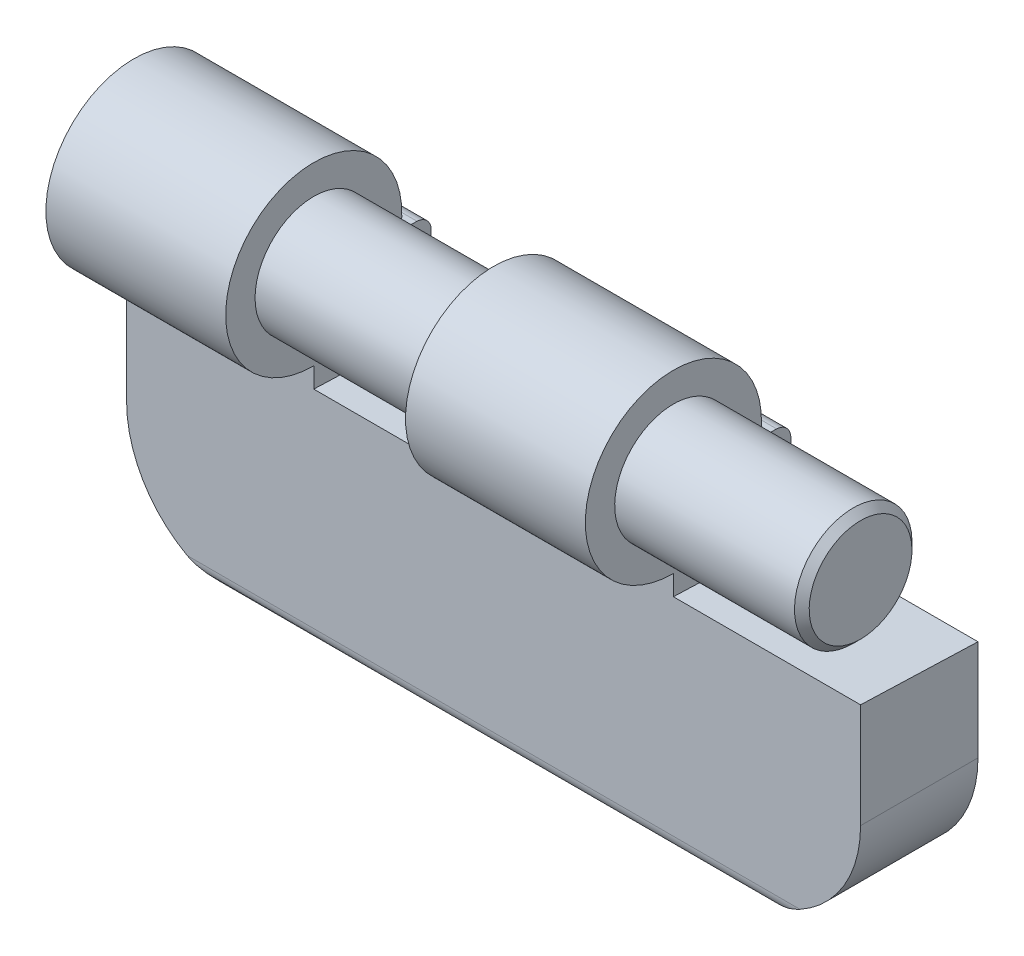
ISO-10303-21;
HEADER;
FILE_DESCRIPTION(('STEP AP214'),'2;1');
FILE_NAME('part.step','',(''),(''),'','','');
FILE_SCHEMA(('AUTOMOTIVE_DESIGN { 1 0 10303 214 1 1 1 1 }'));
ENDSEC;
DATA;
#1=APPLICATION_CONTEXT('core data for automotive mechanical design processes');
#2=APPLICATION_PROTOCOL_DEFINITION('international standard','automotive_design',2000,#1);
#3=PRODUCT_CONTEXT('',#1,'mechanical');
#4=PRODUCT('Part','Part','',(#3));
#5=PRODUCT_RELATED_PRODUCT_CATEGORY('part','',(#4));
#6=PRODUCT_DEFINITION_FORMATION('','',#4);
#7=PRODUCT_DEFINITION_CONTEXT('part definition',#1,'design');
#8=PRODUCT_DEFINITION('design','',#6,#7);
#9=PRODUCT_DEFINITION_SHAPE('','',#8);
#10=(LENGTH_UNIT() NAMED_UNIT(*) SI_UNIT(.MILLI.,.METRE.));
#11=(NAMED_UNIT(*) PLANE_ANGLE_UNIT() SI_UNIT($,.RADIAN.));
#12=(NAMED_UNIT(*) SI_UNIT($,.STERADIAN.) SOLID_ANGLE_UNIT());
#13=UNCERTAINTY_MEASURE_WITH_UNIT(LENGTH_MEASURE(1.E-05),#10,'distance_accuracy_value','');
#14=(GEOMETRIC_REPRESENTATION_CONTEXT(3) GLOBAL_UNCERTAINTY_ASSIGNED_CONTEXT((#13)) GLOBAL_UNIT_ASSIGNED_CONTEXT((#10,
#11,#12)) REPRESENTATION_CONTEXT('',''));
#15=CARTESIAN_POINT('',(0.,0.,0.));
#16=DIRECTION('',(0.,0.,1.));
#17=DIRECTION('',(1.,0.,0.));
#18=AXIS2_PLACEMENT_3D('',#15,#16,#17);
#19=CARTESIAN_POINT('',(-2.125,0.,7.));
#20=DIRECTION('',(0.,0.,1.));
#21=DIRECTION('',(1.,0.,0.));
#22=AXIS2_PLACEMENT_3D('',#19,#20,#21);
#23=PLANE('',#22);
#24=CARTESIAN_POINT('',(0.,0.,7.));
#25=DIRECTION('',(0.,0.,-1.));
#26=DIRECTION('',(-1.,0.,0.));
#27=AXIS2_PLACEMENT_3D('',#24,#25,#26);
#28=CIRCLE('',#27,4.25);
#29=CARTESIAN_POINT('',(-4.25,0.,7.));
#30=VERTEX_POINT('',#29);
#31=EDGE_CURVE('E18',#30,#30,#28,.T.);
#32=ORIENTED_EDGE('',*,*,#31,.T.);
#33=EDGE_LOOP('',(#32));
#34=FACE_BOUND('',#33,.T.);
#35=ADVANCED_FACE('F14',(#34),#23,.F.);
#36=CARTESIAN_POINT('',(29.875,0.,7.));
#37=DIRECTION('',(0.,0.,1.));
#38=DIRECTION('',(1.,0.,0.));
#39=AXIS2_PLACEMENT_3D('',#36,#37,#38);
#40=PLANE('',#39);
#41=CARTESIAN_POINT('',(32.,0.,7.));
#42=DIRECTION('',(0.,0.,-1.));
#43=DIRECTION('',(-1.,0.,0.));
#44=AXIS2_PLACEMENT_3D('',#41,#42,#43);
#45=CIRCLE('',#44,4.25);
#46=CARTESIAN_POINT('',(27.75,0.,7.));
#47=VERTEX_POINT('',#46);
#48=EDGE_CURVE('E203',#47,#47,#45,.T.);
#49=ORIENTED_EDGE('',*,*,#48,.T.);
#50=EDGE_LOOP('',(#49));
#51=FACE_BOUND('',#50,.T.);
#52=ADVANCED_FACE('F321',(#51),#40,.F.);
#53=CARTESIAN_POINT('',(0.,0.,4.75));
#54=DIRECTION('',(0.,0.,-1.));
#55=DIRECTION('',(-1.,0.,0.));
#56=AXIS2_PLACEMENT_3D('',#53,#54,#55);
#57=CYLINDRICAL_SURFACE('',#56,4.25);
#58=ORIENTED_EDGE('',*,*,#31,.F.);
#59=EDGE_LOOP('',(#58));
#60=FACE_BOUND('',#59,.T.);
#61=CARTESIAN_POINT('',(0.,0.,2.5));
#62=DIRECTION('',(0.,0.,-1.));
#63=DIRECTION('',(-1.,0.,0.));
#64=AXIS2_PLACEMENT_3D('',#61,#62,#63);
#65=CIRCLE('',#64,4.25);
#66=CARTESIAN_POINT('',(-4.25,0.,2.5));
#67=VERTEX_POINT('',#66);
#68=EDGE_CURVE('E502',#67,#67,#65,.T.);
#69=ORIENTED_EDGE('',*,*,#68,.T.);
#70=EDGE_LOOP('',(#69));
#71=FACE_BOUND('',#70,.T.);
#72=ADVANCED_FACE('F328',(#60,#71),#57,.F.);
#73=CARTESIAN_POINT('',(32.,0.,4.75));
#74=DIRECTION('',(0.,0.,-1.));
#75=DIRECTION('',(-1.,0.,0.));
#76=AXIS2_PLACEMENT_3D('',#73,#74,#75);
#77=CYLINDRICAL_SURFACE('',#76,4.25);
#78=ORIENTED_EDGE('',*,*,#48,.F.);
#79=EDGE_LOOP('',(#78));
#80=FACE_BOUND('',#79,.T.);
#81=CARTESIAN_POINT('',(32.,0.,2.5));
#82=DIRECTION('',(0.,0.,-1.));
#83=DIRECTION('',(-1.,0.,0.));
#84=AXIS2_PLACEMENT_3D('',#81,#82,#83);
#85=CIRCLE('',#84,4.25);
#86=CARTESIAN_POINT('',(27.75,0.,2.5));
#87=VERTEX_POINT('',#86);
#88=EDGE_CURVE('E132',#87,#87,#85,.T.);
#89=ORIENTED_EDGE('',*,*,#88,.T.);
#90=EDGE_LOOP('',(#89));
#91=FACE_BOUND('',#90,.T.);
#92=ADVANCED_FACE('F337',(#80,#91),#77,.F.);
#93=CARTESIAN_POINT('',(-3.25,0.,2.5));
#94=DIRECTION('',(0.,0.,-1.));
#95=DIRECTION('',(-1.,0.,0.));
#96=AXIS2_PLACEMENT_3D('',#93,#94,#95);
#97=PLANE('',#96);
#98=CARTESIAN_POINT('',(0.,0.,2.5));
#99=DIRECTION('',(0.,0.,-1.));
#100=DIRECTION('',(-1.,0.,0.));
#101=AXIS2_PLACEMENT_3D('',#98,#99,#100);
#102=CIRCLE('',#101,2.25);
#103=CARTESIAN_POINT('',(-2.25,0.,2.5));
#104=VERTEX_POINT('',#103);
#105=EDGE_CURVE('E144',#104,#104,#102,.T.);
#106=ORIENTED_EDGE('',*,*,#105,.T.);
#107=EDGE_LOOP('',(#106));
#108=FACE_BOUND('',#107,.T.);
#109=ORIENTED_EDGE('',*,*,#68,.F.);
#110=EDGE_LOOP('',(#109));
#111=FACE_BOUND('',#110,.T.);
#112=ADVANCED_FACE('F249',(#108,#111),#97,.F.);
#113=CARTESIAN_POINT('',(28.75,0.,2.5));
#114=DIRECTION('',(0.,0.,-1.));
#115=DIRECTION('',(-1.,0.,0.));
#116=AXIS2_PLACEMENT_3D('',#113,#114,#115);
#117=PLANE('',#116);
#118=CARTESIAN_POINT('',(32.,0.,2.5));
#119=DIRECTION('',(0.,0.,-1.));
#120=DIRECTION('',(-1.,0.,0.));
#121=AXIS2_PLACEMENT_3D('',#118,#119,#120);
#122=CIRCLE('',#121,2.25);
#123=CARTESIAN_POINT('',(29.75,0.,2.5));
#124=VERTEX_POINT('',#123);
#125=EDGE_CURVE('E147',#124,#124,#122,.T.);
#126=ORIENTED_EDGE('',*,*,#125,.T.);
#127=EDGE_LOOP('',(#126));
#128=FACE_BOUND('',#127,.T.);
#129=ORIENTED_EDGE('',*,*,#88,.F.);
#130=EDGE_LOOP('',(#129));
#131=FACE_BOUND('',#130,.T.);
#132=ADVANCED_FACE('F265',(#128,#131),#117,.F.);
#133=CARTESIAN_POINT('',(41.,-10.,7.));
#134=DIRECTION('',(0.,-1.,0.));
#135=DIRECTION('',(1.,0.,0.));
#136=AXIS2_PLACEMENT_3D('',#133,#134,#135);
#137=PLANE('',#136);
#138=DIRECTION('',(0.,0.,1.));
#139=VECTOR('',#138,1.);
#140=CARTESIAN_POINT('',(33.,-10.,7.));
#141=LINE('',#140,#139);
#142=CARTESIAN_POINT('',(33.,-10.,0.));
#143=VERTEX_POINT('',#142);
#144=CARTESIAN_POINT('',(33.,-10.,7.));
#145=VERTEX_POINT('',#144);
#146=EDGE_CURVE('E33',#143,#145,#141,.T.);
#147=ORIENTED_EDGE('',*,*,#146,.T.);
#148=DIRECTION('',(1.,0.,0.));
#149=VECTOR('',#148,1.);
#150=CARTESIAN_POINT('',(41.,-10.,7.));
#151=LINE('',#150,#149);
#152=CARTESIAN_POINT('',(-1.,-10.,7.));
#153=VERTEX_POINT('',#152);
#154=EDGE_CURVE('E126',#145,#153,#151,.F.);
#155=ORIENTED_EDGE('',*,*,#154,.T.);
#156=DIRECTION('',(0.,0.,1.));
#157=VECTOR('',#156,1.);
#158=CARTESIAN_POINT('',(-1.,-10.,7.));
#159=LINE('',#158,#157);
#160=CARTESIAN_POINT('',(-1.,-10.,0.));
#161=VERTEX_POINT('',#160);
#162=EDGE_CURVE('E135',#153,#161,#159,.F.);
#163=ORIENTED_EDGE('',*,*,#162,.T.);
#164=DIRECTION('',(-1.,0.,0.));
#165=VECTOR('',#164,1.);
#166=CARTESIAN_POINT('',(41.,-10.,0.));
#167=LINE('',#166,#165);
#168=EDGE_CURVE('E218',#143,#161,#167,.T.);
#169=ORIENTED_EDGE('',*,*,#168,.F.);
#170=EDGE_LOOP('',(#147,#155,#163,#169));
#171=FACE_BOUND('',#170,.T.);
#172=ADVANCED_FACE('F143',(#171),#137,.T.);
#173=CARTESIAN_POINT('',(0.,0.,1.25));
#174=DIRECTION('',(0.,0.,-1.));
#175=DIRECTION('',(-1.,0.,0.));
#176=AXIS2_PLACEMENT_3D('',#173,#174,#175);
#177=CYLINDRICAL_SURFACE('',#176,2.25);
#178=CARTESIAN_POINT('',(0.,0.,0.));
#179=DIRECTION('',(0.,0.,-1.));
#180=DIRECTION('',(-1.,0.,0.));
#181=AXIS2_PLACEMENT_3D('',#178,#179,#180);
#182=CIRCLE('',#181,2.25);
#183=CARTESIAN_POINT('',(-2.25,0.,0.));
#184=VERTEX_POINT('',#183);
#185=EDGE_CURVE('E24',#184,#184,#182,.F.);
#186=ORIENTED_EDGE('',*,*,#185,.F.);
#187=EDGE_LOOP('',(#186));
#188=FACE_BOUND('',#187,.T.);
#189=ORIENTED_EDGE('',*,*,#105,.F.);
#190=EDGE_LOOP('',(#189));
#191=FACE_BOUND('',#190,.T.);
#192=ADVANCED_FACE('F317',(#188,#191),#177,.F.);
#193=CARTESIAN_POINT('',(32.,0.,1.25));
#194=DIRECTION('',(0.,0.,-1.));
#195=DIRECTION('',(-1.,0.,0.));
#196=AXIS2_PLACEMENT_3D('',#193,#194,#195);
#197=CYLINDRICAL_SURFACE('',#196,2.25);
#198=CARTESIAN_POINT('',(32.,0.,0.));
#199=DIRECTION('',(0.,0.,-1.));
#200=DIRECTION('',(-1.,0.,0.));
#201=AXIS2_PLACEMENT_3D('',#198,#199,#200);
#202=CIRCLE('',#201,2.25);
#203=CARTESIAN_POINT('',(29.75,0.,0.));
#204=VERTEX_POINT('',#203);
#205=EDGE_CURVE('E9',#204,#204,#202,.F.);
#206=ORIENTED_EDGE('',*,*,#205,.F.);
#207=EDGE_LOOP('',(#206));
#208=FACE_BOUND('',#207,.T.);
#209=ORIENTED_EDGE('',*,*,#125,.F.);
#210=EDGE_LOOP('',(#209));
#211=FACE_BOUND('',#210,.T.);
#212=ADVANCED_FACE('F309',(#208,#211),#197,.F.);
#213=CARTESIAN_POINT('',(41.,12.5,0.));
#214=DIRECTION('',(1.,0.,0.));
#215=DIRECTION('',(0.,1.,0.));
#216=AXIS2_PLACEMENT_3D('',#213,#214,#215);
#217=PLANE('',#216);
#218=DIRECTION('',(0.,0.0348994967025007,0.999390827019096));
#219=VECTOR('',#218,1.);
#220=CARTESIAN_POINT('',(41.,4.85,0.));
#221=LINE('',#220,#219);
#222=CARTESIAN_POINT('',(41.,4.85,0.));
#223=VERTEX_POINT('',#222);
#224=CARTESIAN_POINT('',(41.,5.12936615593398,8.));
#225=VERTEX_POINT('',#224);
#226=EDGE_CURVE('E157',#223,#225,#221,.T.);
#227=ORIENTED_EDGE('',*,*,#226,.T.);
#228=DIRECTION('',(0.,1.,0.));
#229=VECTOR('',#228,1.);
#230=CARTESIAN_POINT('',(41.,12.5,8.));
#231=LINE('',#230,#229);
#232=CARTESIAN_POINT('',(41.,-2.,8.));
#233=VERTEX_POINT('',#232);
#234=EDGE_CURVE('E154',#225,#233,#231,.F.);
#235=ORIENTED_EDGE('',*,*,#234,.T.);
#236=DIRECTION('',(0.,0.,-1.));
#237=VECTOR('',#236,1.);
#238=CARTESIAN_POINT('',(41.,-2.,0.));
#239=LINE('',#238,#237);
#240=CARTESIAN_POINT('',(41.,-2.,0.));
#241=VERTEX_POINT('',#240);
#242=EDGE_CURVE('E229',#241,#233,#239,.F.);
#243=ORIENTED_EDGE('',*,*,#242,.F.);
#244=DIRECTION('',(0.,1.,0.));
#245=VECTOR('',#244,1.);
#246=CARTESIAN_POINT('',(41.,-10.,0.));
#247=LINE('',#246,#245);
#248=EDGE_CURVE('E222',#223,#241,#247,.F.);
#249=ORIENTED_EDGE('',*,*,#248,.F.);
#250=EDGE_LOOP('',(#227,#235,#243,#249));
#251=FACE_BOUND('',#250,.T.);
#252=ADVANCED_FACE('F307',(#251),#217,.T.);
#253=CARTESIAN_POINT('',(33.,-2.,0.));
#254=DIRECTION('',(0.,0.,-1.));
#255=DIRECTION('',(-1.,0.,0.));
#256=AXIS2_PLACEMENT_3D('',#253,#254,#255);
#257=CYLINDRICAL_SURFACE('',#256,8.);
#258=ORIENTED_EDGE('',*,*,#242,.T.);
#259=CARTESIAN_POINT('',(33.,-2.,8.));
#260=DIRECTION('',(0.,0.,-1.));
#261=DIRECTION('',(-1.,0.,0.));
#262=AXIS2_PLACEMENT_3D('',#259,#260,#261);
#263=CIRCLE('',#262,8.);
#264=CARTESIAN_POINT('',(36.8729833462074,-9.,8.));
#265=VERTEX_POINT('',#264);
#266=EDGE_CURVE('E141',#233,#265,#263,.T.);
#267=ORIENTED_EDGE('',*,*,#266,.T.);
#268=CARTESIAN_POINT('',(36.8729833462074,-9.,8.));
#269=CARTESIAN_POINT('',(36.8150611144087,-9.03204875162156,7.99999095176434));
#270=CARTESIAN_POINT('',(36.7567590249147,-9.06336585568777,7.99846056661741));
#271=CARTESIAN_POINT('',(36.6395251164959,-9.12448038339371,7.99269833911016));
#272=CARTESIAN_POINT('',(36.5805935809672,-9.15427845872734,7.98846766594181));
#273=CARTESIAN_POINT('',(36.4032423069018,-9.24121872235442,7.97225892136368));
#274=CARTESIAN_POINT('',(36.2840024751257,-9.29605254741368,7.95676097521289));
#275=CARTESIAN_POINT('',(36.0445697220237,-9.39915667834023,7.91852145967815));
#276=CARTESIAN_POINT('',(35.9243835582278,-9.44745557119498,7.8958129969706));
#277=CARTESIAN_POINT('',(35.6828286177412,-9.53784294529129,7.84464292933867));
#278=CARTESIAN_POINT('',(35.5614590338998,-9.57992681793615,7.81617709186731));
#279=CARTESIAN_POINT('',(35.2403850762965,-9.68273685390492,7.73517218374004));
#280=CARTESIAN_POINT('',(35.0399619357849,-9.73829278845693,7.67883823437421));
#281=CARTESIAN_POINT('',(34.6377980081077,-9.83328651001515,7.55814944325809));
#282=CARTESIAN_POINT('',(34.4360567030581,-9.87271752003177,7.49379124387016));
#283=CARTESIAN_POINT('',(33.8292935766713,-9.96742194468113,7.29320124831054));
#284=CARTESIAN_POINT('',(33.4226678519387,-9.99912712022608,7.1494356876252));
#285=CARTESIAN_POINT('',(33.0112434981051,-9.99999406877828,7.00397515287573));
#286=CARTESIAN_POINT('',(33.005621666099,-9.99999999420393,7.00198753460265));
#287=CARTESIAN_POINT('',(33.,-10.,7.));
#288=B_SPLINE_CURVE_WITH_KNOTS('',3,(#268,#269,#270,#271,#272,#273,#274,#275,#276,#277,#278,
#279,#280,#281,#282,#283,#284,#285,#286,#287),.UNSPECIFIED.,.F.,.F.,(4,2,2,2,2,2,2,2,2,4),(0.,
0.198535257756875,0.396984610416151,0.792983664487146,1.18719018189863,1.58168756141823,
2.22713013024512,2.87284368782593,4.16406208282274,4.18195063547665),.UNSPECIFIED.);
#289=EDGE_CURVE('E156',#265,#145,#288,.T.);
#290=ORIENTED_EDGE('',*,*,#289,.T.);
#291=ORIENTED_EDGE('',*,*,#146,.F.);
#292=CARTESIAN_POINT('',(33.,-2.,0.));
#293=DIRECTION('',(0.,0.,-1.));
#294=DIRECTION('',(-1.,0.,0.));
#295=AXIS2_PLACEMENT_3D('',#292,#293,#294);
#296=CIRCLE('',#295,8.);
#297=EDGE_CURVE('E219',#241,#143,#296,.T.);
#298=ORIENTED_EDGE('',*,*,#297,.F.);
#299=EDGE_LOOP('',(#258,#267,#290,#291,#298));
#300=FACE_BOUND('',#299,.T.);
#301=ADVANCED_FACE('F239',(#300),#257,.T.);
#302=CARTESIAN_POINT('',(41.,-9.,7.));
#303=DIRECTION('',(1.,0.,0.));
#304=DIRECTION('',(0.,1.,0.));
#305=AXIS2_PLACEMENT_3D('',#302,#303,#304);
#306=CYLINDRICAL_SURFACE('',#305,1.);
#307=ORIENTED_EDGE('',*,*,#289,.F.);
#308=DIRECTION('',(1.,0.,0.));
#309=VECTOR('',#308,1.);
#310=CARTESIAN_POINT('',(41.,-9.,8.));
#311=LINE('',#310,#309);
#312=CARTESIAN_POINT('',(-4.8729833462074,-9.,8.));
#313=VERTEX_POINT('',#312);
#314=EDGE_CURVE('E127',#265,#313,#311,.F.);
#315=ORIENTED_EDGE('',*,*,#314,.T.);
#316=CARTESIAN_POINT('',(-1.,-10.,7.));
#317=CARTESIAN_POINT('',(-0.999999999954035,-10.,7.00000113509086));
#318=CARTESIAN_POINT('',(-1.00000028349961,-9.9999999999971,7.00000227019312));
#319=CARTESIAN_POINT('',(-1.0000011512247,-9.99999999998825,7.00000443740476));
#320=CARTESIAN_POINT('',(-1.00000174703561,-9.99999999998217,7.00000546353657));
#321=CARTESIAN_POINT('',(-1.00000317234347,-9.99999999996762,7.00000752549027));
#322=CARTESIAN_POINT('',(-1.00000402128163,-9.99999999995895,7.00000854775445));
#323=CARTESIAN_POINT('',(-1.00000583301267,-9.99999999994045,7.0000104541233));
#324=CARTESIAN_POINT('',(-1.00000679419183,-9.99999999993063,7.00001133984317));
#325=CARTESIAN_POINT('',(-1.00001030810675,-9.99999999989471,7.00001438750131));
#326=CARTESIAN_POINT('',(-1.00001300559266,-9.99999999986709,7.0000163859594));
#327=CARTESIAN_POINT('',(-1.00001851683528,-9.99999999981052,7.00001987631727));
#328=CARTESIAN_POINT('',(-1.00002131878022,-9.99999999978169,7.00002138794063));
#329=CARTESIAN_POINT('',(-1.00003250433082,-9.99999999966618,7.00002724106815));
#330=CARTESIAN_POINT('',(-1.00004104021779,-9.99999999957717,7.0000313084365));
#331=CARTESIAN_POINT('',(-1.00005767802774,-9.99999999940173,7.00003778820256));
#332=CARTESIAN_POINT('',(-1.00006573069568,-9.99999999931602,7.00004032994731));
#333=CARTESIAN_POINT('',(-1.00010070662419,-9.99999999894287,7.00005141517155));
#334=CARTESIAN_POINT('',(-1.00012758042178,-9.99999999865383,7.00006004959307));
#335=CARTESIAN_POINT('',(-1.00017747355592,-9.99999999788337,7.00007361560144));
#336=CARTESIAN_POINT('',(-1.00020038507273,-9.99999999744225,7.0000789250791));
#337=CARTESIAN_POINT('',(-1.00036969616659,-9.99999999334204,7.00012172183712));
#338=CARTESIAN_POINT('',(-1.00051077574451,-9.9999999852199,7.00017732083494));
#339=CARTESIAN_POINT('',(-1.00106355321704,-9.9999999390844,7.00038730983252));
#340=CARTESIAN_POINT('',(-1.00147894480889,-9.99999987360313,7.00052818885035));
#341=CARTESIAN_POINT('',(-1.00310652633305,-9.99999949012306,7.00108820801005));
#342=CARTESIAN_POINT('',(-1.00431494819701,-9.99999892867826,7.00152150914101));
#343=CARTESIAN_POINT('',(-1.00930137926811,-9.9999954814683,7.00330123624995));
#344=CARTESIAN_POINT('',(-1.0130835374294,-9.99999019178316,7.00463162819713));
#345=CARTESIAN_POINT('',(-1.06010383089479,-9.99989110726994,7.0211821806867));
#346=CARTESIAN_POINT('',(-1.1033150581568,-9.9994497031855,7.03650704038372));
#347=CARTESIAN_POINT('',(-1.19040332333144,-9.99785412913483,7.0673077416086));
#348=CARTESIAN_POINT('',(-1.23428051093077,-9.99668924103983,7.08278234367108));
#349=CARTESIAN_POINT('',(-1.36187675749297,-9.99225031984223,7.12773209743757));
#350=CARTESIAN_POINT('',(-1.44558376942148,-9.9880215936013,7.15715678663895));
#351=CARTESIAN_POINT('',(-1.62314876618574,-9.97624836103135,7.21921672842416));
#352=CARTESIAN_POINT('',(-1.71700007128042,-9.9683624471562,7.25180602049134));
#353=CARTESIAN_POINT('',(-1.90558764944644,-9.94915023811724,7.31665261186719));
#354=CARTESIAN_POINT('',(-2.00032279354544,-9.93778846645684,7.34890276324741));
#355=CARTESIAN_POINT('',(-2.16430735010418,-9.91513020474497,7.40394308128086));
#356=CARTESIAN_POINT('',(-2.23359300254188,-9.90462980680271,7.42695538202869));
#357=CARTESIAN_POINT('',(-2.37188825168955,-9.88180321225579,7.47229823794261));
#358=CARTESIAN_POINT('',(-2.44089810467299,-9.86948166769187,7.49463036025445));
#359=CARTESIAN_POINT('',(-2.64458796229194,-9.83033569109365,7.55951422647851));
#360=CARTESIAN_POINT('',(-2.77910596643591,-9.80089013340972,7.60102919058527));
#361=CARTESIAN_POINT('',(-3.06607885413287,-9.73020509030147,7.6857492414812));
#362=CARTESIAN_POINT('',(-3.21843949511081,-9.6878973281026,7.72839300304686));
#363=CARTESIAN_POINT('',(-3.52307620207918,-9.59339942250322,7.80727586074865));
#364=CARTESIAN_POINT('',(-3.67534332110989,-9.54113855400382,7.84346529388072));
#365=CARTESIAN_POINT('',(-3.98767848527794,-9.4231617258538,7.90871697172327));
#366=CARTESIAN_POINT('',(-4.14763649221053,-9.356807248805,7.93718950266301));
#367=CARTESIAN_POINT('',(-4.38500747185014,-9.24908682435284,7.96919937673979));
#368=CARTESIAN_POINT('',(-4.46360517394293,-9.21186772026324,7.97808165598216));
#369=CARTESIAN_POINT('',(-4.61982425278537,-9.13473562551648,7.99165592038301));
#370=CARTESIAN_POINT('',(-4.6974459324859,-9.09482349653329,7.99634923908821));
#371=CARTESIAN_POINT('',(-4.84604497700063,-9.01530699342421,8.000618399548));
#372=CARTESIAN_POINT('',(-4.91710588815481,-8.97587815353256,8.00053073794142));
#373=CARTESIAN_POINT('',(-5.0578345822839,-8.89496625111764,7.99529461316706));
#374=CARTESIAN_POINT('',(-5.12750303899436,-8.85348421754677,7.99014866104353));
#375=CARTESIAN_POINT('',(-5.26405536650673,-8.76935502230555,7.97396695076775));
#376=CARTESIAN_POINT('',(-5.33096501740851,-8.72673363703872,7.9630180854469));
#377=CARTESIAN_POINT('',(-5.46240376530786,-8.64026548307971,7.93416664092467));
#378=CARTESIAN_POINT('',(-5.52693535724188,-8.59642008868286,7.91627159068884));
#379=CARTESIAN_POINT('',(-5.64559887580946,-8.51329739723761,7.87465801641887));
#380=CARTESIAN_POINT('',(-5.7000763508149,-8.47407086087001,7.85183904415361));
#381=CARTESIAN_POINT('',(-5.80576920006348,-8.39600685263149,7.79839598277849));
#382=CARTESIAN_POINT('',(-5.85697371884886,-8.35717100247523,7.76774745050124));
#383=CARTESIAN_POINT('',(-5.95510168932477,-8.28099249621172,7.69697158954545));
#384=CARTESIAN_POINT('',(-6.00196558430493,-8.24367370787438,7.65673364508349));
#385=CARTESIAN_POINT('',(-6.08831139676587,-8.17350433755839,7.56583531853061));
#386=CARTESIAN_POINT('',(-6.12782354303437,-8.14063561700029,7.51521949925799));
#387=CARTESIAN_POINT('',(-6.18254940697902,-8.09441693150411,7.42584158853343));
#388=CARTESIAN_POINT('',(-6.20115325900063,-8.07852521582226,7.39046500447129));
#389=CARTESIAN_POINT('',(-6.23373860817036,-8.05049089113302,7.31623102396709));
#390=CARTESIAN_POINT('',(-6.24772270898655,-8.03834617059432,7.27737560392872));
#391=CARTESIAN_POINT('',(-6.2703155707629,-8.01863814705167,7.19663930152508));
#392=CARTESIAN_POINT('',(-6.27888107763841,-8.01111172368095,7.15473697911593));
#393=CARTESIAN_POINT('',(-6.28980566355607,-8.00150083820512,7.06951996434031));
#394=CARTESIAN_POINT('',(-6.29216891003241,-7.99941272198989,7.026206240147));
#395=CARTESIAN_POINT('',(-6.29060372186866,-8.00079245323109,6.94474406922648));
#396=CARTESIAN_POINT('',(-6.28736099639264,-8.00365479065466,6.90656900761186));
#397=CARTESIAN_POINT('',(-6.27608015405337,-8.01357080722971,6.83150415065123));
#398=CARTESIAN_POINT('',(-6.26804175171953,-8.0206247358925,6.79461443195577));
#399=CARTESIAN_POINT('',(-6.24763954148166,-8.03841531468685,6.7230221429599));
#400=CARTESIAN_POINT('',(-6.23527697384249,-8.04915090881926,6.68831894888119));
#401=CARTESIAN_POINT('',(-6.20682543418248,-8.0736580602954,6.62164204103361));
#402=CARTESIAN_POINT('',(-6.19073501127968,-8.08743079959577,6.58966939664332));
#403=CARTESIAN_POINT('',(-6.14662481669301,-8.12482193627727,6.51353356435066));
#404=CARTESIAN_POINT('',(-6.11665453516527,-8.1499279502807,6.47122794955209));
#405=CARTESIAN_POINT('',(-6.05145565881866,-8.20359523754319,6.39338041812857));
#406=CARTESIAN_POINT('',(-6.01621335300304,-8.23216548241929,6.35785670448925));
#407=CARTESIAN_POINT('',(-5.92342831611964,-8.30593848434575,6.27710305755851));
#408=CARTESIAN_POINT('',(-5.86348485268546,-8.3523713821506,6.23577826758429));
#409=CARTESIAN_POINT('',(-5.73805560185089,-8.44647313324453,6.16508899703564));
#410=CARTESIAN_POINT('',(-5.67256771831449,-8.49414244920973,6.1357290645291));
#411=CARTESIAN_POINT('',(-5.54899064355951,-8.58114123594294,6.0908615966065));
#412=CARTESIAN_POINT('',(-5.49147527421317,-8.62054289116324,6.07386434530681));
#413=CARTESIAN_POINT('',(-5.37442560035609,-8.69845863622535,6.04564606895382));
#414=CARTESIAN_POINT('',(-5.31488985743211,-8.73697205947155,6.03442925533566));
#415=CARTESIAN_POINT('',(-5.19368651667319,-8.81308803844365,6.01683930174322));
#416=CARTESIAN_POINT('',(-5.13200327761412,-8.85067712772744,6.01051723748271));
#417=CARTESIAN_POINT('',(-5.00741560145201,-8.92429511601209,6.00218245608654));
#418=CARTESIAN_POINT('',(-4.94451071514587,-8.96032342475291,6.00017135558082));
#419=CARTESIAN_POINT('',(-4.76515668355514,-9.05982720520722,5.99971528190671));
#420=CARTESIAN_POINT('',(-4.64756702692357,-9.12128551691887,6.00561103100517));
#421=CARTESIAN_POINT('',(-4.41001555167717,-9.23805041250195,6.0269343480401));
#422=CARTESIAN_POINT('',(-4.29004934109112,-9.29334404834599,6.04238154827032));
#423=CARTESIAN_POINT('',(-4.05398728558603,-9.39519686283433,6.07987570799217));
#424=CARTESIAN_POINT('',(-3.9379590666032,-9.44203650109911,6.10159571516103));
#425=CARTESIAN_POINT('',(-3.70547967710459,-9.52965677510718,6.15031611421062));
#426=CARTESIAN_POINT('',(-3.58903404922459,-9.57046834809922,6.17728777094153));
#427=CARTESIAN_POINT('',(-3.38514241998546,-9.63671900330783,6.22808125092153));
#428=CARTESIAN_POINT('',(-3.2978660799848,-9.66342560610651,6.25095500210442));
#429=CARTESIAN_POINT('',(-3.12300858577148,-9.71369594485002,6.29868771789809));
#430=CARTESIAN_POINT('',(-3.03542762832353,-9.73726142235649,6.32354557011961));
#431=CARTESIAN_POINT('',(-2.85800422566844,-9.78179758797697,6.37550850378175));
#432=CARTESIAN_POINT('',(-2.7681552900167,-9.8026978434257,6.40265160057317));
#433=CARTESIAN_POINT('',(-2.58799361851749,-9.84135101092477,6.45844393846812));
#434=CARTESIAN_POINT('',(-2.49768028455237,-9.85909588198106,6.48709679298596));
#435=CARTESIAN_POINT('',(-2.28535804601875,-9.89703696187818,6.55575478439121));
#436=CARTESIAN_POINT('',(-2.16326968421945,-9.91593303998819,6.59623687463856));
#437=CARTESIAN_POINT('',(-1.92013032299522,-9.94784475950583,6.67827533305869));
#438=CARTESIAN_POINT('',(-1.79908182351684,-9.96091981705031,6.7198160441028));
#439=CARTESIAN_POINT('',(-1.62411162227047,-9.97580124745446,6.78049617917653));
#440=CARTESIAN_POINT('',(-1.57024208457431,-9.97983325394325,6.79926513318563));
#441=CARTESIAN_POINT('',(-1.46226195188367,-9.9868174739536,6.83702493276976));
#442=CARTESIAN_POINT('',(-1.40815126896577,-9.98976522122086,6.85601637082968));
#443=CARTESIAN_POINT('',(-1.29741873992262,-9.99467024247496,6.8949519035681));
#444=CARTESIAN_POINT('',(-1.24079596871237,-9.99657567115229,6.91489960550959));
#445=CARTESIAN_POINT('',(-1.12841584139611,-9.9991638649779,6.95462479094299));
#446=CARTESIAN_POINT('',(-1.07265832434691,-9.9998646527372,6.97440029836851));
#447=CARTESIAN_POINT('',(-1.01308246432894,-9.99999019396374,6.99536864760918));
#448=CARTESIAN_POINT('',(-1.00929927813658,-9.99999548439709,6.99669948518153));
#449=CARTESIAN_POINT('',(-1.00431260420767,-9.99999892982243,6.99847932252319));
#450=CARTESIAN_POINT('',(-1.00310497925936,-9.99999949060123,6.99891233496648));
#451=CARTESIAN_POINT('',(-1.00147840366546,-9.99999987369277,6.99947200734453));
#452=CARTESIAN_POINT('',(-1.00106321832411,-9.99999993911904,6.9996128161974));
#453=CARTESIAN_POINT('',(-1.00051068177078,-9.9999999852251,6.99982271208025));
#454=CARTESIAN_POINT('',(-1.00036963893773,-9.99999999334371,6.99987829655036));
#455=CARTESIAN_POINT('',(-1.00020036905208,-9.99999999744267,6.99992108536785));
#456=CARTESIAN_POINT('',(-1.00017746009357,-9.99999999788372,6.99992639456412));
#457=CARTESIAN_POINT('',(-1.00012757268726,-9.99999999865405,6.9999399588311));
#458=CARTESIAN_POINT('',(-1.00010070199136,-9.99999999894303,6.99994859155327));
#459=CARTESIAN_POINT('',(-1.00006572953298,-9.99999999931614,6.99995967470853));
#460=CARTESIAN_POINT('',(-1.00005767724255,-9.99999999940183,6.99996221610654));
#461=CARTESIAN_POINT('',(-1.00004104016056,-9.99999999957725,6.99996869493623));
#462=CARTESIAN_POINT('',(-1.0000325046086,-9.99999999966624,6.99997276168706));
#463=CARTESIAN_POINT('',(-1.00002131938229,-9.99999999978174,6.999978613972));
#464=CARTESIAN_POINT('',(-1.00001851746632,-9.99999999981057,6.99998012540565));
#465=CARTESIAN_POINT('',(-1.00001300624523,-9.99999999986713,6.99998361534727));
#466=CARTESIAN_POINT('',(-1.00001030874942,-9.99999999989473,6.99998561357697));
#467=CARTESIAN_POINT('',(-1.00000679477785,-9.99999999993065,6.99998866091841));
#468=CARTESIAN_POINT('',(-1.00000583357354,-9.99999999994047,6.99998954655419));
#469=CARTESIAN_POINT('',(-1.00000402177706,-9.99999999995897,6.99999145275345));
#470=CARTESIAN_POINT('',(-1.00000317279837,-9.99999999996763,6.99999247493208));
#471=CARTESIAN_POINT('',(-1.00000174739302,-9.99999999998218,6.99999453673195));
#472=CARTESIAN_POINT('',(-1.00000115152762,-9.99999999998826,6.99999556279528));
#473=CARTESIAN_POINT('',(-1.00000028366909,-9.99999999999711,6.99999772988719));
#474=CARTESIAN_POINT('',(-1.00000000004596,-10.,6.9999988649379));
#475=CARTESIAN_POINT('',(-1.,-10.,7.));
#476=B_SPLINE_CURVE_WITH_KNOTS('',3,(#316,#317,#318,#319,#320,#321,#322,#323,#324,#325,#326,
#327,#328,#329,#330,#331,#332,#333,#334,#335,#336,#337,#338,#339,#340,#341,#342,#343,#344,#345,
#346,#347,#348,#349,#350,#351,#352,#353,#354,#355,#356,#357,#358,#359,#360,#361,#362,#363,#364,
#365,#366,#367,#368,#369,#370,#371,#372,#373,#374,#375,#376,#377,#378,#379,#380,#381,#382,#383,
#384,#385,#386,#387,#388,#389,#390,#391,#392,#393,#394,#395,#396,#397,#398,#399,#400,#401,#402,
#403,#404,#405,#406,#407,#408,#409,#410,#411,#412,#413,#414,#415,#416,#417,#418,#419,#420,#421,
#422,#423,#424,#425,#426,#427,#428,#429,#430,#431,#432,#433,#434,#435,#436,#437,#438,#439,#440,
#441,#442,#443,#444,#445,#446,#447,#448,#449,#450,#451,#452,#453,#454,#455,#456,#457,#458,#459,
#460,#461,#462,#463,#464,#465,#466,#467,#468,#469,#470,#471,#472,#473,#474,#475),.UNSPECIFIED.,
.T.,.F.,(4,2,2,2,2,2,2,2,2,2,2,2,2,2,2,2,2,2,2,2,2,2,2,2,2,2,2,2,2,2,2,2,2,2,2,2,2,2,2,2,2,2,2,
2,2,2,2,2,2,2,2,2,2,2,2,2,2,2,2,2,2,2,2,2,2,2,2,2,2,2,2,2,2,2,2,2,2,2,2,4),(0.,
3.40698807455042E-06,6.95098753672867E-06,1.09194301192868E-05,1.48365709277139E-05,
2.48615345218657E-05,3.44048785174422E-05,6.26951660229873E-05,8.80001725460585E-05,
0.000172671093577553,0.000243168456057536,0.000696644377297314,0.00201374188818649,
0.0058634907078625,0.0178931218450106,0.155425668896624,0.295045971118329,0.561488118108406,
0.86041553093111,1.16250194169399,1.38375265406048,1.60444765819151,2.0357002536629,
2.52663985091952,3.02120774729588,3.54680912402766,3.80894423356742,4.07099586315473,
4.31462921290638,4.55814167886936,4.7981067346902,5.0378124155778,5.25011637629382,
5.46309140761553,5.67865342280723,5.89330849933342,6.02188854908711,6.15039600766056,
6.27991674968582,6.40935044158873,6.52404735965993,6.63875110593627,6.7534219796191,
6.86813755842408,7.03997635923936,7.2122700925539,7.46988659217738,7.72760092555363,
7.94258106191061,8.15771760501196,8.37506987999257,8.59250364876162,8.99026222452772,
9.38884109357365,9.76954965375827,10.1482308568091,10.4304395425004,10.7124911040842,
11.000898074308,11.2900297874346,11.6799025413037,12.0656990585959,12.2372547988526,
12.4095094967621,12.589694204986,12.7671589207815,12.7791918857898,12.7830390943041,
12.7843555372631,12.7848088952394,12.7848793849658,12.7849640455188,12.7849893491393,
12.785017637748,12.7850271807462,12.7850372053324,12.7850411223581,12.7850450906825,
12.7850486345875,12.7850520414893),.UNSPECIFIED.);
#477=EDGE_CURVE('E121',#153,#313,#476,.T.);
#478=ORIENTED_EDGE('',*,*,#477,.F.);
#479=ORIENTED_EDGE('',*,*,#154,.F.);
#480=EDGE_LOOP('',(#307,#315,#478,#479));
#481=FACE_BOUND('',#480,.T.);
#482=ADVANCED_FACE('F124',(#481),#306,.T.);
#483=CARTESIAN_POINT('',(-1.,-2.,0.));
#484=DIRECTION('',(0.,0.,-1.));
#485=DIRECTION('',(-1.,0.,0.));
#486=AXIS2_PLACEMENT_3D('',#483,#484,#485);
#487=CYLINDRICAL_SURFACE('',#486,8.);
#488=CARTESIAN_POINT('',(-1.,-2.,0.));
#489=DIRECTION('',(0.,0.,-1.));
#490=DIRECTION('',(-1.,0.,0.));
#491=AXIS2_PLACEMENT_3D('',#488,#489,#490);
#492=CIRCLE('',#491,8.);
#493=CARTESIAN_POINT('',(-9.,-2.,0.));
#494=VERTEX_POINT('',#493);
#495=EDGE_CURVE('E138',#161,#494,#492,.T.);
#496=ORIENTED_EDGE('',*,*,#495,.F.);
#497=ORIENTED_EDGE('',*,*,#162,.F.);
#498=ORIENTED_EDGE('',*,*,#477,.T.);
#499=CARTESIAN_POINT('',(-1.,-2.,8.));
#500=DIRECTION('',(0.,0.,-1.));
#501=DIRECTION('',(-1.,0.,0.));
#502=AXIS2_PLACEMENT_3D('',#499,#500,#501);
#503=CIRCLE('',#502,8.);
#504=CARTESIAN_POINT('',(-9.,-2.,8.));
#505=VERTEX_POINT('',#504);
#506=EDGE_CURVE('E131',#313,#505,#503,.T.);
#507=ORIENTED_EDGE('',*,*,#506,.T.);
#508=DIRECTION('',(0.,0.,1.));
#509=VECTOR('',#508,1.);
#510=CARTESIAN_POINT('',(-9.,-2.,0.));
#511=LINE('',#510,#509);
#512=EDGE_CURVE('E212',#505,#494,#511,.F.);
#513=ORIENTED_EDGE('',*,*,#512,.T.);
#514=EDGE_LOOP('',(#496,#497,#498,#507,#513));
#515=FACE_BOUND('',#514,.T.);
#516=ADVANCED_FACE('F136',(#515),#487,.T.);
#517=CARTESIAN_POINT('',(-9.,12.5,0.));
#518=DIRECTION('',(1.,0.,0.));
#519=DIRECTION('',(0.,1.,0.));
#520=AXIS2_PLACEMENT_3D('',#517,#518,#519);
#521=PLANE('',#520);
#522=DIRECTION('',(0.,1.,0.));
#523=VECTOR('',#522,1.);
#524=CARTESIAN_POINT('',(-9.,12.5,8.));
#525=LINE('',#524,#523);
#526=CARTESIAN_POINT('',(-9.,5.12936615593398,8.));
#527=VERTEX_POINT('',#526);
#528=EDGE_CURVE('E210',#527,#505,#525,.F.);
#529=ORIENTED_EDGE('',*,*,#528,.F.);
#530=DIRECTION('',(0.,0.0348994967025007,0.999390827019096));
#531=VECTOR('',#530,1.);
#532=CARTESIAN_POINT('',(-9.,4.85,0.));
#533=LINE('',#532,#531);
#534=CARTESIAN_POINT('',(-9.,4.85,0.));
#535=VERTEX_POINT('',#534);
#536=EDGE_CURVE('E213',#535,#527,#533,.T.);
#537=ORIENTED_EDGE('',*,*,#536,.F.);
#538=DIRECTION('',(0.,1.,0.));
#539=VECTOR('',#538,1.);
#540=CARTESIAN_POINT('',(-9.,-10.,0.));
#541=LINE('',#540,#539);
#542=EDGE_CURVE('E224',#494,#535,#541,.T.);
#543=ORIENTED_EDGE('',*,*,#542,.F.);
#544=ORIENTED_EDGE('',*,*,#512,.F.);
#545=EDGE_LOOP('',(#529,#537,#543,#544));
#546=FACE_BOUND('',#545,.T.);
#547=ADVANCED_FACE('F264',(#546),#521,.F.);
#548=CARTESIAN_POINT('',(41.,4.85,0.));
#549=DIRECTION('',(0.,0.999390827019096,-0.034899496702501));
#550=DIRECTION('',(0.,0.034899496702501,0.999390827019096));
#551=AXIS2_PLACEMENT_3D('',#548,#549,#550);
#552=PLANE('',#551);
#553=ORIENTED_EDGE('',*,*,#536,.T.);
#554=DIRECTION('',(1.,0.,0.));
#555=VECTOR('',#554,1.);
#556=CARTESIAN_POINT('',(41.,5.12936615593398,8.));
#557=LINE('',#556,#555);
#558=CARTESIAN_POINT('',(-8.5,5.12936615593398,8.));
#559=VERTEX_POINT('',#558);
#560=EDGE_CURVE('E190',#559,#527,#557,.F.);
#561=ORIENTED_EDGE('',*,*,#560,.F.);
#562=DIRECTION('',(0.,-0.0348994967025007,-0.999390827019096));
#563=VECTOR('',#562,1.);
#564=CARTESIAN_POINT('',(-8.5,5.12936615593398,8.));
#565=LINE('',#564,#563);
#566=CARTESIAN_POINT('',(-8.5,4.85,0.));
#567=VERTEX_POINT('',#566);
#568=EDGE_CURVE('E402',#559,#567,#565,.T.);
#569=ORIENTED_EDGE('',*,*,#568,.T.);
#570=DIRECTION('',(1.,0.,0.));
#571=VECTOR('',#570,1.);
#572=CARTESIAN_POINT('',(41.,4.85,0.));
#573=LINE('',#572,#571);
#574=EDGE_CURVE('E200',#567,#535,#573,.F.);
#575=ORIENTED_EDGE('',*,*,#574,.T.);
#576=EDGE_LOOP('',(#553,#561,#569,#575));
#577=FACE_BOUND('',#576,.T.);
#578=ADVANCED_FACE('F268',(#577),#552,.T.);
#579=CARTESIAN_POINT('',(3.75,11.513702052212,0.965100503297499));
#580=DIRECTION('',(0.,0.999390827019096,-0.034899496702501));
#581=DIRECTION('',(0.,0.034899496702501,0.999390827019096));
#582=AXIS2_PLACEMENT_3D('',#579,#580,#581);
#583=PLANE('',#582);
#584=DIRECTION('',(0.,0.034899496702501,0.999390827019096));
#585=VECTOR('',#584,1.);
#586=CARTESIAN_POINT('',(3.75,11.513702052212,0.965100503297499));
#587=LINE('',#586,#585);
#588=CARTESIAN_POINT('',(3.75,11.5524707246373,2.07529002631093));
#589=VERTEX_POINT('',#588);
#590=CARTESIAN_POINT('',(3.75,11.513702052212,0.965100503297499));
#591=VERTEX_POINT('',#590);
#592=EDGE_CURVE('E193',#589,#591,#587,.F.);
#593=ORIENTED_EDGE('',*,*,#592,.T.);
#594=DIRECTION('',(1.,0.,0.));
#595=VECTOR('',#594,1.);
#596=CARTESIAN_POINT('',(3.75,11.513702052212,0.965100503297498));
#597=LINE('',#596,#595);
#598=CARTESIAN_POINT('',(-8.5,11.513702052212,0.965100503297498));
#599=VERTEX_POINT('',#598);
#600=EDGE_CURVE('E194',#599,#591,#597,.T.);
#601=ORIENTED_EDGE('',*,*,#600,.F.);
#602=DIRECTION('',(0.,0.0348994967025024,0.999390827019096));
#603=VECTOR('',#602,1.);
#604=CARTESIAN_POINT('',(-8.5,11.513702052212,0.965100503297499));
#605=LINE('',#604,#603);
#606=CARTESIAN_POINT('',(-8.5,11.5524707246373,2.07529002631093));
#607=VERTEX_POINT('',#606);
#608=EDGE_CURVE('E405',#599,#607,#605,.T.);
#609=ORIENTED_EDGE('',*,*,#608,.T.);
#610=DIRECTION('',(1.,0.,0.));
#611=VECTOR('',#610,1.);
#612=CARTESIAN_POINT('',(3.75,11.5524707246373,2.07529002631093));
#613=LINE('',#612,#611);
#614=EDGE_CURVE('E180',#589,#607,#613,.F.);
#615=ORIENTED_EDGE('',*,*,#614,.F.);
#616=EDGE_LOOP('',(#593,#601,#609,#615));
#617=FACE_BOUND('',#616,.T.);
#618=ADVANCED_FACE('F281',(#617),#583,.T.);
#619=CARTESIAN_POINT('',(3.75,10.5143112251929,1.));
#620=DIRECTION('',(1.,0.,0.));
#621=DIRECTION('',(0.,1.,0.));
#622=AXIS2_PLACEMENT_3D('',#619,#620,#621);
#623=CYLINDRICAL_SURFACE('',#622,1.);
#624=CARTESIAN_POINT('',(3.75,10.5143112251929,1.));
#625=DIRECTION('',(1.,0.,0.));
#626=DIRECTION('',(0.,1.,0.));
#627=AXIS2_PLACEMENT_3D('',#624,#625,#626);
#628=CIRCLE('',#627,1.);
#629=CARTESIAN_POINT('',(3.75,10.5143112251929,0.));
#630=VERTEX_POINT('',#629);
#631=EDGE_CURVE('E393',#630,#591,#628,.T.);
#632=ORIENTED_EDGE('',*,*,#631,.F.);
#633=DIRECTION('',(-1.,0.,0.));
#634=VECTOR('',#633,1.);
#635=CARTESIAN_POINT('',(41.,10.5143112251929,0.));
#636=LINE('',#635,#634);
#637=CARTESIAN_POINT('',(-8.5,10.5143112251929,0.));
#638=VERTEX_POINT('',#637);
#639=EDGE_CURVE('E479',#638,#630,#636,.F.);
#640=ORIENTED_EDGE('',*,*,#639,.F.);
#641=CARTESIAN_POINT('',(-8.5,10.5143112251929,1.));
#642=DIRECTION('',(1.,0.,0.));
#643=DIRECTION('',(0.,1.,0.));
#644=AXIS2_PLACEMENT_3D('',#641,#642,#643);
#645=CIRCLE('',#644,1.);
#646=EDGE_CURVE('E198',#638,#599,#645,.T.);
#647=ORIENTED_EDGE('',*,*,#646,.T.);
#648=ORIENTED_EDGE('',*,*,#600,.T.);
#649=EDGE_LOOP('',(#632,#640,#647,#648));
#650=FACE_BOUND('',#649,.T.);
#651=ADVANCED_FACE('F277',(#650),#623,.T.);
#652=CARTESIAN_POINT('',(41.,4.85,0.));
#653=DIRECTION('',(0.,0.999390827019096,-0.034899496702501));
#654=DIRECTION('',(0.,0.034899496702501,0.999390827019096));
#655=AXIS2_PLACEMENT_3D('',#652,#653,#654);
#656=PLANE('',#655);
#657=DIRECTION('',(0.,-0.0348994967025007,-0.999390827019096));
#658=VECTOR('',#657,1.);
#659=CARTESIAN_POINT('',(16.,5.12936615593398,8.));
#660=LINE('',#659,#658);
#661=CARTESIAN_POINT('',(16.,5.12936615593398,8.));
#662=VERTEX_POINT('',#661);
#663=CARTESIAN_POINT('',(16.,4.85,0.));
#664=VERTEX_POINT('',#663);
#665=EDGE_CURVE('E386',#662,#664,#660,.T.);
#666=ORIENTED_EDGE('',*,*,#665,.T.);
#667=DIRECTION('',(-1.,0.,0.));
#668=VECTOR('',#667,1.);
#669=CARTESIAN_POINT('',(41.,4.85,0.));
#670=LINE('',#669,#668);
#671=CARTESIAN_POINT('',(3.75,4.85,0.));
#672=VERTEX_POINT('',#671);
#673=EDGE_CURVE('E461',#672,#664,#670,.F.);
#674=ORIENTED_EDGE('',*,*,#673,.F.);
#675=DIRECTION('',(0.,0.034899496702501,0.999390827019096));
#676=VECTOR('',#675,1.);
#677=CARTESIAN_POINT('',(3.75,4.85,0.));
#678=LINE('',#677,#676);
#679=CARTESIAN_POINT('',(3.75,5.12936615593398,8.));
#680=VERTEX_POINT('',#679);
#681=EDGE_CURVE('E185',#672,#680,#678,.T.);
#682=ORIENTED_EDGE('',*,*,#681,.T.);
#683=DIRECTION('',(1.,0.,0.));
#684=VECTOR('',#683,1.);
#685=CARTESIAN_POINT('',(41.,5.12936615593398,8.));
#686=LINE('',#685,#684);
#687=EDGE_CURVE('E181',#680,#662,#686,.T.);
#688=ORIENTED_EDGE('',*,*,#687,.T.);
#689=EDGE_LOOP('',(#666,#674,#682,#688));
#690=FACE_BOUND('',#689,.T.);
#691=ADVANCED_FACE('F280',(#690),#656,.T.);
#692=CARTESIAN_POINT('',(16.,11.5524707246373,2.07529002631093));
#693=DIRECTION('',(0.,0.999390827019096,-0.034899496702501));
#694=DIRECTION('',(0.,0.034899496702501,0.999390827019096));
#695=AXIS2_PLACEMENT_3D('',#692,#693,#694);
#696=PLANE('',#695);
#697=DIRECTION('',(0.,0.0348994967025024,0.999390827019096));
#698=VECTOR('',#697,1.);
#699=CARTESIAN_POINT('',(16.,11.513702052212,0.965100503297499));
#700=LINE('',#699,#698);
#701=CARTESIAN_POINT('',(16.,11.513702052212,0.965100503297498));
#702=VERTEX_POINT('',#701);
#703=CARTESIAN_POINT('',(16.,11.5524707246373,2.07529002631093));
#704=VERTEX_POINT('',#703);
#705=EDGE_CURVE('E184',#702,#704,#700,.T.);
#706=ORIENTED_EDGE('',*,*,#705,.T.);
#707=DIRECTION('',(-1.,0.,0.));
#708=VECTOR('',#707,1.);
#709=CARTESIAN_POINT('',(16.,11.5524707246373,2.07529002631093));
#710=LINE('',#709,#708);
#711=CARTESIAN_POINT('',(28.25,11.5524707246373,2.07529002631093));
#712=VERTEX_POINT('',#711);
#713=EDGE_CURVE('E170',#712,#704,#710,.T.);
#714=ORIENTED_EDGE('',*,*,#713,.F.);
#715=DIRECTION('',(0.,0.034899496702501,0.999390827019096));
#716=VECTOR('',#715,1.);
#717=CARTESIAN_POINT('',(28.25,11.5524707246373,2.07529002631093));
#718=LINE('',#717,#716);
#719=CARTESIAN_POINT('',(28.25,11.513702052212,0.965100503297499));
#720=VERTEX_POINT('',#719);
#721=EDGE_CURVE('E173',#712,#720,#718,.F.);
#722=ORIENTED_EDGE('',*,*,#721,.T.);
#723=DIRECTION('',(-1.,0.,0.));
#724=VECTOR('',#723,1.);
#725=CARTESIAN_POINT('',(16.,11.513702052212,0.965100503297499));
#726=LINE('',#725,#724);
#727=EDGE_CURVE('E174',#702,#720,#726,.F.);
#728=ORIENTED_EDGE('',*,*,#727,.F.);
#729=EDGE_LOOP('',(#706,#714,#722,#728));
#730=FACE_BOUND('',#729,.T.);
#731=ADVANCED_FACE('F289',(#730),#696,.T.);
#732=CARTESIAN_POINT('',(16.,10.5143112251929,1.));
#733=DIRECTION('',(-1.,0.,0.));
#734=DIRECTION('',(0.,-1.,0.));
#735=AXIS2_PLACEMENT_3D('',#732,#733,#734);
#736=CYLINDRICAL_SURFACE('',#735,1.);
#737=CARTESIAN_POINT('',(16.,10.5143112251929,1.));
#738=DIRECTION('',(-1.,0.,0.));
#739=DIRECTION('',(0.,-1.,0.));
#740=AXIS2_PLACEMENT_3D('',#737,#738,#739);
#741=CIRCLE('',#740,1.);
#742=CARTESIAN_POINT('',(16.,10.5143112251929,0.));
#743=VERTEX_POINT('',#742);
#744=EDGE_CURVE('E178',#743,#702,#741,.F.);
#745=ORIENTED_EDGE('',*,*,#744,.T.);
#746=ORIENTED_EDGE('',*,*,#727,.T.);
#747=CARTESIAN_POINT('',(28.25,10.5143112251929,1.));
#748=DIRECTION('',(-1.,0.,0.));
#749=DIRECTION('',(0.,-1.,0.));
#750=AXIS2_PLACEMENT_3D('',#747,#748,#749);
#751=CIRCLE('',#750,1.);
#752=CARTESIAN_POINT('',(28.25,10.5143112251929,0.));
#753=VERTEX_POINT('',#752);
#754=EDGE_CURVE('E376',#753,#720,#751,.F.);
#755=ORIENTED_EDGE('',*,*,#754,.F.);
#756=DIRECTION('',(-1.,0.,0.));
#757=VECTOR('',#756,1.);
#758=CARTESIAN_POINT('',(41.,10.5143112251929,0.));
#759=LINE('',#758,#757);
#760=EDGE_CURVE('E453',#743,#753,#759,.F.);
#761=ORIENTED_EDGE('',*,*,#760,.F.);
#762=EDGE_LOOP('',(#745,#746,#755,#761));
#763=FACE_BOUND('',#762,.T.);
#764=ADVANCED_FACE('F296',(#763),#736,.T.);
#765=CARTESIAN_POINT('',(41.,-10.,0.));
#766=DIRECTION('',(0.,0.,-1.));
#767=DIRECTION('',(-1.,0.,0.));
#768=AXIS2_PLACEMENT_3D('',#765,#766,#767);
#769=PLANE('',#768);
#770=ORIENTED_EDGE('',*,*,#205,.T.);
#771=EDGE_LOOP('',(#770));
#772=FACE_BOUND('',#771,.T.);
#773=ORIENTED_EDGE('',*,*,#185,.T.);
#774=EDGE_LOOP('',(#773));
#775=FACE_BOUND('',#774,.T.);
#776=ORIENTED_EDGE('',*,*,#297,.T.);
#777=ORIENTED_EDGE('',*,*,#168,.T.);
#778=ORIENTED_EDGE('',*,*,#495,.T.);
#779=ORIENTED_EDGE('',*,*,#542,.T.);
#780=ORIENTED_EDGE('',*,*,#574,.F.);
#781=DIRECTION('',(0.,1.,0.));
#782=VECTOR('',#781,1.);
#783=CARTESIAN_POINT('',(-8.5,-10.,0.));
#784=LINE('',#783,#782);
#785=EDGE_CURVE('E435',#567,#638,#784,.T.);
#786=ORIENTED_EDGE('',*,*,#785,.T.);
#787=ORIENTED_EDGE('',*,*,#639,.T.);
#788=DIRECTION('',(0.,1.,0.));
#789=VECTOR('',#788,1.);
#790=CARTESIAN_POINT('',(3.75,-10.,0.));
#791=LINE('',#790,#789);
#792=EDGE_CURVE('E470',#630,#672,#791,.F.);
#793=ORIENTED_EDGE('',*,*,#792,.T.);
#794=ORIENTED_EDGE('',*,*,#673,.T.);
#795=DIRECTION('',(0.,1.,0.));
#796=VECTOR('',#795,1.);
#797=CARTESIAN_POINT('',(16.,-10.,0.));
#798=LINE('',#797,#796);
#799=EDGE_CURVE('E458',#664,#743,#798,.T.);
#800=ORIENTED_EDGE('',*,*,#799,.T.);
#801=ORIENTED_EDGE('',*,*,#760,.T.);
#802=DIRECTION('',(0.,1.,0.));
#803=VECTOR('',#802,1.);
#804=CARTESIAN_POINT('',(28.25,-10.,0.));
#805=LINE('',#804,#803);
#806=CARTESIAN_POINT('',(28.25,4.85,0.));
#807=VERTEX_POINT('',#806);
#808=EDGE_CURVE('E445',#753,#807,#805,.F.);
#809=ORIENTED_EDGE('',*,*,#808,.T.);
#810=DIRECTION('',(-1.,0.,0.));
#811=VECTOR('',#810,1.);
#812=CARTESIAN_POINT('',(41.,4.85,0.));
#813=LINE('',#812,#811);
#814=EDGE_CURVE('E430',#807,#223,#813,.F.);
#815=ORIENTED_EDGE('',*,*,#814,.T.);
#816=ORIENTED_EDGE('',*,*,#248,.T.);
#817=EDGE_LOOP('',(#776,#777,#778,#779,#780,#786,#787,#793,#794,#800,#801,#809,#815,#816));
#818=FACE_BOUND('',#817,.T.);
#819=ADVANCED_FACE('F16',(#772,#775,#818),#769,.T.);
#820=CARTESIAN_POINT('',(41.,4.85,0.));
#821=DIRECTION('',(0.,0.999390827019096,-0.034899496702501));
#822=DIRECTION('',(0.,0.034899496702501,0.999390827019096));
#823=AXIS2_PLACEMENT_3D('',#820,#821,#822);
#824=PLANE('',#823);
#825=ORIENTED_EDGE('',*,*,#226,.F.);
#826=ORIENTED_EDGE('',*,*,#814,.F.);
#827=DIRECTION('',(0.,0.034899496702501,0.999390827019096));
#828=VECTOR('',#827,1.);
#829=CARTESIAN_POINT('',(28.25,4.85,0.));
#830=LINE('',#829,#828);
#831=CARTESIAN_POINT('',(28.25,5.12936615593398,8.));
#832=VERTEX_POINT('',#831);
#833=EDGE_CURVE('E163',#807,#832,#830,.T.);
#834=ORIENTED_EDGE('',*,*,#833,.T.);
#835=DIRECTION('',(1.,0.,0.));
#836=VECTOR('',#835,1.);
#837=CARTESIAN_POINT('',(41.,5.12936615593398,8.));
#838=LINE('',#837,#836);
#839=EDGE_CURVE('E160',#832,#225,#838,.T.);
#840=ORIENTED_EDGE('',*,*,#839,.T.);
#841=EDGE_LOOP('',(#825,#826,#834,#840));
#842=FACE_BOUND('',#841,.T.);
#843=ADVANCED_FACE('F304',(#842),#824,.T.);
#844=CARTESIAN_POINT('',(41.,5.12936615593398,8.));
#845=DIRECTION('',(0.,0.,1.));
#846=DIRECTION('',(1.,0.,0.));
#847=AXIS2_PLACEMENT_3D('',#844,#845,#846);
#848=PLANE('',#847);
#849=ORIENTED_EDGE('',*,*,#560,.T.);
#850=ORIENTED_EDGE('',*,*,#528,.T.);
#851=ORIENTED_EDGE('',*,*,#506,.F.);
#852=ORIENTED_EDGE('',*,*,#314,.F.);
#853=ORIENTED_EDGE('',*,*,#266,.F.);
#854=ORIENTED_EDGE('',*,*,#234,.F.);
#855=ORIENTED_EDGE('',*,*,#839,.F.);
#856=DIRECTION('',(0.,1.,0.));
#857=VECTOR('',#856,1.);
#858=CARTESIAN_POINT('',(28.25,12.5,8.));
#859=LINE('',#858,#857);
#860=CARTESIAN_POINT('',(28.25,6.5,8.));
#861=VERTEX_POINT('',#860);
#862=EDGE_CURVE('E368',#861,#832,#859,.F.);
#863=ORIENTED_EDGE('',*,*,#862,.F.);
#864=DIRECTION('',(1.,0.,0.));
#865=VECTOR('',#864,1.);
#866=CARTESIAN_POINT('',(41.,6.5,8.));
#867=LINE('',#866,#865);
#868=CARTESIAN_POINT('',(16.,6.5,8.));
#869=VERTEX_POINT('',#868);
#870=EDGE_CURVE('E166',#861,#869,#867,.F.);
#871=ORIENTED_EDGE('',*,*,#870,.T.);
#872=DIRECTION('',(0.,1.,0.));
#873=VECTOR('',#872,1.);
#874=CARTESIAN_POINT('',(16.,12.5,8.));
#875=LINE('',#874,#873);
#876=EDGE_CURVE('E388',#869,#662,#875,.F.);
#877=ORIENTED_EDGE('',*,*,#876,.T.);
#878=ORIENTED_EDGE('',*,*,#687,.F.);
#879=DIRECTION('',(0.,1.,0.));
#880=VECTOR('',#879,1.);
#881=CARTESIAN_POINT('',(3.75,12.5,8.));
#882=LINE('',#881,#880);
#883=CARTESIAN_POINT('',(3.75,6.5,8.));
#884=VERTEX_POINT('',#883);
#885=EDGE_CURVE('E392',#884,#680,#882,.F.);
#886=ORIENTED_EDGE('',*,*,#885,.F.);
#887=DIRECTION('',(1.,0.,0.));
#888=VECTOR('',#887,1.);
#889=CARTESIAN_POINT('',(41.,6.5,8.));
#890=LINE('',#889,#888);
#891=CARTESIAN_POINT('',(-8.5,6.5,8.));
#892=VERTEX_POINT('',#891);
#893=EDGE_CURVE('E169',#884,#892,#890,.F.);
#894=ORIENTED_EDGE('',*,*,#893,.T.);
#895=DIRECTION('',(0.,1.,0.));
#896=VECTOR('',#895,1.);
#897=CARTESIAN_POINT('',(-8.5,12.5,8.));
#898=LINE('',#897,#896);
#899=EDGE_CURVE('E404',#892,#559,#898,.F.);
#900=ORIENTED_EDGE('',*,*,#899,.T.);
#901=EDGE_LOOP('',(#849,#850,#851,#852,#853,#854,#855,#863,#871,#877,#878,#886,#894,#900));
#902=FACE_BOUND('',#901,.T.);
#903=ADVANCED_FACE('F247',(#902),#848,.T.);
#904=CARTESIAN_POINT('',(16.,12.5,8.));
#905=DIRECTION('',(-1.,0.,0.));
#906=DIRECTION('',(0.,-1.,0.));
#907=AXIS2_PLACEMENT_3D('',#904,#905,#906);
#908=CYLINDRICAL_SURFACE('',#907,6.);
#909=ORIENTED_EDGE('',*,*,#870,.F.);
#910=CARTESIAN_POINT('',(28.25,12.5,8.));
#911=DIRECTION('',(-1.,0.,0.));
#912=DIRECTION('',(0.,-1.,0.));
#913=AXIS2_PLACEMENT_3D('',#910,#911,#912);
#914=CIRCLE('',#913,6.);
#915=EDGE_CURVE('E237',#712,#861,#914,.F.);
#916=ORIENTED_EDGE('',*,*,#915,.F.);
#917=ORIENTED_EDGE('',*,*,#713,.T.);
#918=CARTESIAN_POINT('',(16.,12.5,8.));
#919=DIRECTION('',(-1.,0.,0.));
#920=DIRECTION('',(0.,-1.,0.));
#921=AXIS2_PLACEMENT_3D('',#918,#919,#920);
#922=CIRCLE('',#921,6.);
#923=EDGE_CURVE('E363',#704,#869,#922,.F.);
#924=ORIENTED_EDGE('',*,*,#923,.T.);
#925=EDGE_LOOP('',(#909,#916,#917,#924));
#926=FACE_BOUND('',#925,.T.);
#927=ADVANCED_FACE('F302',(#926),#908,.T.);
#928=CARTESIAN_POINT('',(28.25,12.5,0.));
#929=DIRECTION('',(1.,0.,0.));
#930=DIRECTION('',(0.,1.,0.));
#931=AXIS2_PLACEMENT_3D('',#928,#929,#930);
#932=PLANE('',#931);
#933=ORIENTED_EDGE('',*,*,#915,.T.);
#934=ORIENTED_EDGE('',*,*,#862,.T.);
#935=ORIENTED_EDGE('',*,*,#833,.F.);
#936=ORIENTED_EDGE('',*,*,#808,.F.);
#937=ORIENTED_EDGE('',*,*,#754,.T.);
#938=ORIENTED_EDGE('',*,*,#721,.F.);
#939=EDGE_LOOP('',(#933,#934,#935,#936,#937,#938));
#940=FACE_BOUND('',#939,.T.);
#941=CARTESIAN_POINT('',(28.25,12.5,8.));
#942=DIRECTION('',(-1.,0.,0.));
#943=DIRECTION('',(0.,-1.,0.));
#944=AXIS2_PLACEMENT_3D('',#941,#942,#943);
#945=CIRCLE('',#944,4.);
#946=CARTESIAN_POINT('',(28.25,8.5,8.));
#947=VERTEX_POINT('',#946);
#948=EDGE_CURVE('E177',#947,#947,#945,.T.);
#949=ORIENTED_EDGE('',*,*,#948,.T.);
#950=EDGE_LOOP('',(#949));
#951=FACE_BOUND('',#950,.T.);
#952=ADVANCED_FACE('F294',(#940,#951),#932,.T.);
#953=CARTESIAN_POINT('',(16.,12.5,0.));
#954=DIRECTION('',(1.,0.,0.));
#955=DIRECTION('',(0.,1.,0.));
#956=AXIS2_PLACEMENT_3D('',#953,#954,#955);
#957=PLANE('',#956);
#958=CARTESIAN_POINT('',(16.,12.5,8.));
#959=DIRECTION('',(-1.,0.,0.));
#960=DIRECTION('',(0.,-1.,0.));
#961=AXIS2_PLACEMENT_3D('',#958,#959,#960);
#962=CIRCLE('',#961,4.);
#963=CARTESIAN_POINT('',(16.,8.5,8.));
#964=VERTEX_POINT('',#963);
#965=EDGE_CURVE('E383',#964,#964,#962,.T.);
#966=ORIENTED_EDGE('',*,*,#965,.F.);
#967=EDGE_LOOP('',(#966));
#968=FACE_BOUND('',#967,.T.);
#969=ORIENTED_EDGE('',*,*,#876,.F.);
#970=ORIENTED_EDGE('',*,*,#923,.F.);
#971=ORIENTED_EDGE('',*,*,#705,.F.);
#972=ORIENTED_EDGE('',*,*,#744,.F.);
#973=ORIENTED_EDGE('',*,*,#799,.F.);
#974=ORIENTED_EDGE('',*,*,#665,.F.);
#975=EDGE_LOOP('',(#969,#970,#971,#972,#973,#974));
#976=FACE_BOUND('',#975,.T.);
#977=ADVANCED_FACE('F291',(#968,#976),#957,.F.);
#978=CARTESIAN_POINT('',(3.75,12.5,8.));
#979=DIRECTION('',(1.,0.,0.));
#980=DIRECTION('',(0.,1.,0.));
#981=AXIS2_PLACEMENT_3D('',#978,#979,#980);
#982=CYLINDRICAL_SURFACE('',#981,6.);
#983=ORIENTED_EDGE('',*,*,#893,.F.);
#984=CARTESIAN_POINT('',(3.75,12.5,8.));
#985=DIRECTION('',(1.,0.,0.));
#986=DIRECTION('',(0.,1.,0.));
#987=AXIS2_PLACEMENT_3D('',#984,#985,#986);
#988=CIRCLE('',#987,6.);
#989=EDGE_CURVE('E389',#589,#884,#988,.T.);
#990=ORIENTED_EDGE('',*,*,#989,.F.);
#991=ORIENTED_EDGE('',*,*,#614,.T.);
#992=CARTESIAN_POINT('',(-8.5,12.5,8.));
#993=DIRECTION('',(1.,0.,0.));
#994=DIRECTION('',(0.,1.,0.));
#995=AXIS2_PLACEMENT_3D('',#992,#993,#994);
#996=CIRCLE('',#995,6.);
#997=EDGE_CURVE('E403',#607,#892,#996,.T.);
#998=ORIENTED_EDGE('',*,*,#997,.T.);
#999=EDGE_LOOP('',(#983,#990,#991,#998));
#1000=FACE_BOUND('',#999,.T.);
#1001=ADVANCED_FACE('F285',(#1000),#982,.T.);
#1002=CARTESIAN_POINT('',(3.75,12.5,0.));
#1003=DIRECTION('',(1.,0.,0.));
#1004=DIRECTION('',(0.,1.,0.));
#1005=AXIS2_PLACEMENT_3D('',#1002,#1003,#1004);
#1006=PLANE('',#1005);
#1007=ORIENTED_EDGE('',*,*,#989,.T.);
#1008=ORIENTED_EDGE('',*,*,#885,.T.);
#1009=ORIENTED_EDGE('',*,*,#681,.F.);
#1010=ORIENTED_EDGE('',*,*,#792,.F.);
#1011=ORIENTED_EDGE('',*,*,#631,.T.);
#1012=ORIENTED_EDGE('',*,*,#592,.F.);
#1013=EDGE_LOOP('',(#1007,#1008,#1009,#1010,#1011,#1012));
#1014=FACE_BOUND('',#1013,.T.);
#1015=CARTESIAN_POINT('',(3.75,12.5,8.));
#1016=DIRECTION('',(1.,0.,0.));
#1017=DIRECTION('',(0.,1.,0.));
#1018=AXIS2_PLACEMENT_3D('',#1015,#1016,#1017);
#1019=CIRCLE('',#1018,4.);
#1020=CARTESIAN_POINT('',(3.75,16.5,8.));
#1021=VERTEX_POINT('',#1020);
#1022=EDGE_CURVE('E197',#1021,#1021,#1019,.F.);
#1023=ORIENTED_EDGE('',*,*,#1022,.T.);
#1024=EDGE_LOOP('',(#1023));
#1025=FACE_BOUND('',#1024,.T.);
#1026=ADVANCED_FACE('F274',(#1014,#1025),#1006,.T.);
#1027=CARTESIAN_POINT('',(-8.5,12.5,0.));
#1028=DIRECTION('',(1.,0.,0.));
#1029=DIRECTION('',(0.,1.,0.));
#1030=AXIS2_PLACEMENT_3D('',#1027,#1028,#1029);
#1031=PLANE('',#1030);
#1032=CARTESIAN_POINT('',(-8.5,12.5,8.));
#1033=DIRECTION('',(1.,0.,0.));
#1034=DIRECTION('',(0.,1.,0.));
#1035=AXIS2_PLACEMENT_3D('',#1032,#1033,#1034);
#1036=CIRCLE('',#1035,4.);
#1037=CARTESIAN_POINT('',(-8.5,16.5,8.));
#1038=VERTEX_POINT('',#1037);
#1039=EDGE_CURVE('E400',#1038,#1038,#1036,.F.);
#1040=ORIENTED_EDGE('',*,*,#1039,.F.);
#1041=EDGE_LOOP('',(#1040));
#1042=FACE_BOUND('',#1041,.T.);
#1043=ORIENTED_EDGE('',*,*,#899,.F.);
#1044=ORIENTED_EDGE('',*,*,#997,.F.);
#1045=ORIENTED_EDGE('',*,*,#608,.F.);
#1046=ORIENTED_EDGE('',*,*,#646,.F.);
#1047=ORIENTED_EDGE('',*,*,#785,.F.);
#1048=ORIENTED_EDGE('',*,*,#568,.F.);
#1049=EDGE_LOOP('',(#1043,#1044,#1045,#1046,#1047,#1048));
#1050=FACE_BOUND('',#1049,.T.);
#1051=ADVANCED_FACE('F270',(#1042,#1050),#1031,.F.);
#1052=CARTESIAN_POINT('',(41.,12.5,6.25));
#1053=DIRECTION('',(1.,0.,0.));
#1054=DIRECTION('',(0.,1.,0.));
#1055=AXIS2_PLACEMENT_3D('',#1052,#1053,#1054);
#1056=PLANE('',#1055);
#1057=CARTESIAN_POINT('',(41.0000000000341,12.5,8.));
#1058=DIRECTION('',(-1.,0.,0.));
#1059=DIRECTION('',(0.,-1.,0.));
#1060=AXIS2_PLACEMENT_3D('',#1057,#1058,#1059);
#1061=CIRCLE('',#1060,3.49999999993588);
#1062=CARTESIAN_POINT('',(41.0000000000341,9.00000000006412,8.));
#1063=VERTEX_POINT('',#1062);
#1064=EDGE_CURVE('E509',#1063,#1063,#1061,.T.);
#1065=ORIENTED_EDGE('',*,*,#1064,.F.);
#1066=EDGE_LOOP('',(#1065));
#1067=FACE_BOUND('',#1066,.T.);
#1068=ADVANCED_FACE('F273',(#1067),#1056,.T.);
#1069=CARTESIAN_POINT('',(40.5000000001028,12.5,8.));
#1070=DIRECTION('',(-1.,0.,0.));
#1071=DIRECTION('',(0.,-1.,0.));
#1072=AXIS2_PLACEMENT_3D('',#1069,#1070,#1071);
#1073=CONICAL_SURFACE('',#1072,3.99999999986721,0.785398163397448);
#1074=ORIENTED_EDGE('',*,*,#1064,.T.);
#1075=EDGE_LOOP('',(#1074));
#1076=FACE_BOUND('',#1075,.T.);
#1077=CARTESIAN_POINT('',(40.5,12.5,8.));
#1078=DIRECTION('',(-1.,0.,0.));
#1079=DIRECTION('',(0.,-1.,0.));
#1080=AXIS2_PLACEMENT_3D('',#1077,#1078,#1079);
#1081=CIRCLE('',#1080,4.);
#1082=CARTESIAN_POINT('',(40.5,8.5,8.));
#1083=VERTEX_POINT('',#1082);
#1084=EDGE_CURVE('E512',#1083,#1083,#1081,.T.);
#1085=ORIENTED_EDGE('',*,*,#1084,.F.);
#1086=EDGE_LOOP('',(#1085));
#1087=FACE_BOUND('',#1086,.T.);
#1088=ADVANCED_FACE('F676',(#1076,#1087),#1073,.T.);
#1089=CARTESIAN_POINT('',(16.,12.5,8.));
#1090=DIRECTION('',(-1.,0.,0.));
#1091=DIRECTION('',(0.,-1.,0.));
#1092=AXIS2_PLACEMENT_3D('',#1089,#1090,#1091);
#1093=CYLINDRICAL_SURFACE('',#1092,4.);
#1094=ORIENTED_EDGE('',*,*,#948,.F.);
#1095=EDGE_LOOP('',(#1094));
#1096=FACE_BOUND('',#1095,.T.);
#1097=ORIENTED_EDGE('',*,*,#1084,.T.);
#1098=EDGE_LOOP('',(#1097));
#1099=FACE_BOUND('',#1098,.T.);
#1100=ADVANCED_FACE('F276',(#1096,#1099),#1093,.T.);
#1101=ORIENTED_EDGE('',*,*,#1022,.F.);
#1102=EDGE_LOOP('',(#1101));
#1103=FACE_BOUND('',#1102,.T.);
#1104=ORIENTED_EDGE('',*,*,#965,.T.);
#1105=EDGE_LOOP('',(#1104));
#1106=FACE_BOUND('',#1105,.T.);
#1107=ADVANCED_FACE('F679',(#1103,#1106),#1093,.T.);
#1108=CARTESIAN_POINT('',(-9.,12.5,6.25));
#1109=DIRECTION('',(-1.,0.,0.));
#1110=DIRECTION('',(0.,-1.,0.));
#1111=AXIS2_PLACEMENT_3D('',#1108,#1109,#1110);
#1112=PLANE('',#1111);
#1113=CARTESIAN_POINT('',(-9.0000000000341,12.5,8.));
#1114=DIRECTION('',(1.,0.,0.));
#1115=DIRECTION('',(0.,1.,0.));
#1116=AXIS2_PLACEMENT_3D('',#1113,#1114,#1115);
#1117=CIRCLE('',#1116,3.49999999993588);
#1118=CARTESIAN_POINT('',(-9.0000000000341,15.9999999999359,8.));
#1119=VERTEX_POINT('',#1118);
#1120=EDGE_CURVE('E506',#1119,#1119,#1117,.T.);
#1121=ORIENTED_EDGE('',*,*,#1120,.F.);
#1122=EDGE_LOOP('',(#1121));
#1123=FACE_BOUND('',#1122,.T.);
#1124=ADVANCED_FACE('F700',(#1123),#1112,.T.);
#1125=CARTESIAN_POINT('',(-8.5000000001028,12.5,8.));
#1126=DIRECTION('',(1.,0.,0.));
#1127=DIRECTION('',(0.,1.,0.));
#1128=AXIS2_PLACEMENT_3D('',#1125,#1126,#1127);
#1129=CONICAL_SURFACE('',#1128,3.99999999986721,0.785398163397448);
#1130=ORIENTED_EDGE('',*,*,#1120,.T.);
#1131=EDGE_LOOP('',(#1130));
#1132=FACE_BOUND('',#1131,.T.);
#1133=ORIENTED_EDGE('',*,*,#1039,.T.);
#1134=EDGE_LOOP('',(#1133));
#1135=FACE_BOUND('',#1134,.T.);
#1136=ADVANCED_FACE('F708',(#1132,#1135),#1129,.T.);
#1137=CLOSED_SHELL('',(#35,#52,#72,#92,#112,#132,#172,#192,#212,#252,#301,#482,#516,#547,#578,
#618,#651,#691,#731,#764,#819,#843,#903,#927,#952,#977,#1001,#1026,#1051,#1068,#1088,#1100,
#1107,#1124,#1136));
#1138=MANIFOLD_SOLID_BREP('B1',#1137);
#1139=ADVANCED_BREP_SHAPE_REPRESENTATION('',(#18,#1138),#14);
#1140=SHAPE_DEFINITION_REPRESENTATION(#9,#1139);
ENDSEC;
END-ISO-10303-21;
